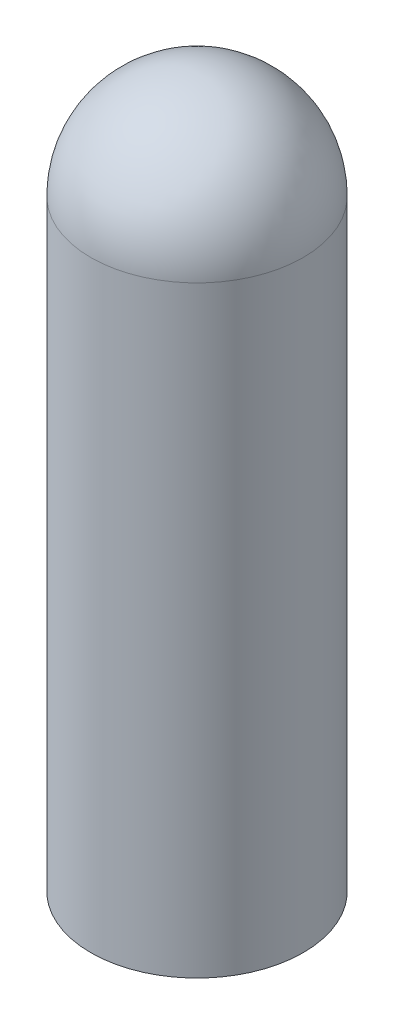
ISO-10303-21;
HEADER;
FILE_DESCRIPTION(('STEP AP214'),'2;1');
FILE_NAME('part.step','',(''),(''),'','','');
FILE_SCHEMA(('AUTOMOTIVE_DESIGN { 1 0 10303 214 1 1 1 1 }'));
ENDSEC;
DATA;
#1=APPLICATION_CONTEXT('core data for automotive mechanical design processes');
#2=APPLICATION_PROTOCOL_DEFINITION('international standard','automotive_design',2000,#1);
#3=PRODUCT_CONTEXT('',#1,'mechanical');
#4=PRODUCT('Part','Part','',(#3));
#5=PRODUCT_RELATED_PRODUCT_CATEGORY('part','',(#4));
#6=PRODUCT_DEFINITION_FORMATION('','',#4);
#7=PRODUCT_DEFINITION_CONTEXT('part definition',#1,'design');
#8=PRODUCT_DEFINITION('design','',#6,#7);
#9=PRODUCT_DEFINITION_SHAPE('','',#8);
#10=(LENGTH_UNIT() NAMED_UNIT(*) SI_UNIT(.MILLI.,.METRE.));
#11=(NAMED_UNIT(*) PLANE_ANGLE_UNIT() SI_UNIT($,.RADIAN.));
#12=(NAMED_UNIT(*) SI_UNIT($,.STERADIAN.) SOLID_ANGLE_UNIT());
#13=UNCERTAINTY_MEASURE_WITH_UNIT(LENGTH_MEASURE(1.E-05),#10,'distance_accuracy_value','');
#14=(GEOMETRIC_REPRESENTATION_CONTEXT(3) GLOBAL_UNCERTAINTY_ASSIGNED_CONTEXT((#13)) GLOBAL_UNIT_ASSIGNED_CONTEXT((#10,
#11,#12)) REPRESENTATION_CONTEXT('',''));
#15=CARTESIAN_POINT('',(0.,0.,0.));
#16=DIRECTION('',(0.,0.,1.));
#17=DIRECTION('',(1.,0.,0.));
#18=AXIS2_PLACEMENT_3D('',#15,#16,#17);
#19=CARTESIAN_POINT('',(0.,5.08,0.));
#20=DIRECTION('',(0.,-1.,0.));
#21=DIRECTION('',(0.,0.,-1.));
#22=AXIS2_PLACEMENT_3D('',#19,#20,#21);
#23=CYLINDRICAL_SURFACE('',#22,0.762);
#24=CARTESIAN_POINT('',(0.,4.318,0.));
#25=DIRECTION('',(0.,-1.,0.));
#26=DIRECTION('',(0.,0.,-1.));
#27=AXIS2_PLACEMENT_3D('',#24,#25,#26);
#28=CIRCLE('',#27,0.762);
#29=CARTESIAN_POINT('',(0.,4.318,-0.762));
#30=VERTEX_POINT('',#29);
#31=EDGE_CURVE('E10',#30,#30,#28,.T.);
#32=ORIENTED_EDGE('',*,*,#31,.T.);
#33=EDGE_LOOP('',(#32));
#34=FACE_BOUND('',#33,.T.);
#35=CARTESIAN_POINT('',(0.,0.,0.));
#36=DIRECTION('',(0.,1.,0.));
#37=DIRECTION('',(0.,0.,1.));
#38=AXIS2_PLACEMENT_3D('',#35,#36,#37);
#39=CIRCLE('',#38,0.762);
#40=CARTESIAN_POINT('',(0.,0.,0.762));
#41=VERTEX_POINT('',#40);
#42=EDGE_CURVE('E40',#41,#41,#39,.T.);
#43=ORIENTED_EDGE('',*,*,#42,.T.);
#44=EDGE_LOOP('',(#43));
#45=FACE_BOUND('',#44,.T.);
#46=ADVANCED_FACE('F33',(#34,#45),#23,.T.);
#47=CARTESIAN_POINT('',(0.,0.,0.));
#48=DIRECTION('',(0.,1.,0.));
#49=DIRECTION('',(0.,0.,1.));
#50=AXIS2_PLACEMENT_3D('',#47,#48,#49);
#51=PLANE('',#50);
#52=ORIENTED_EDGE('',*,*,#42,.F.);
#53=EDGE_LOOP('',(#52));
#54=FACE_BOUND('',#53,.T.);
#55=ADVANCED_FACE('F47',(#54),#51,.F.);
#56=CARTESIAN_POINT('',(0.,4.318,0.));
#57=DIRECTION('',(0.,1.,0.));
#58=DIRECTION('',(0.,0.,1.));
#59=AXIS2_PLACEMENT_3D('',#56,#57,#58);
#60=SPHERICAL_SURFACE('',#59,0.762);
#61=ORIENTED_EDGE('',*,*,#31,.F.);
#62=EDGE_LOOP('',(#61));
#63=FACE_BOUND('',#62,.T.);
#64=ADVANCED_FACE('F35',(#63),#60,.T.);
#65=CLOSED_SHELL('',(#46,#55,#64));
#66=MANIFOLD_SOLID_BREP('B2',#65);
#67=ADVANCED_BREP_SHAPE_REPRESENTATION('',(#18,#66),#14);
#68=SHAPE_DEFINITION_REPRESENTATION(#9,#67);
ENDSEC;
END-ISO-10303-21;
